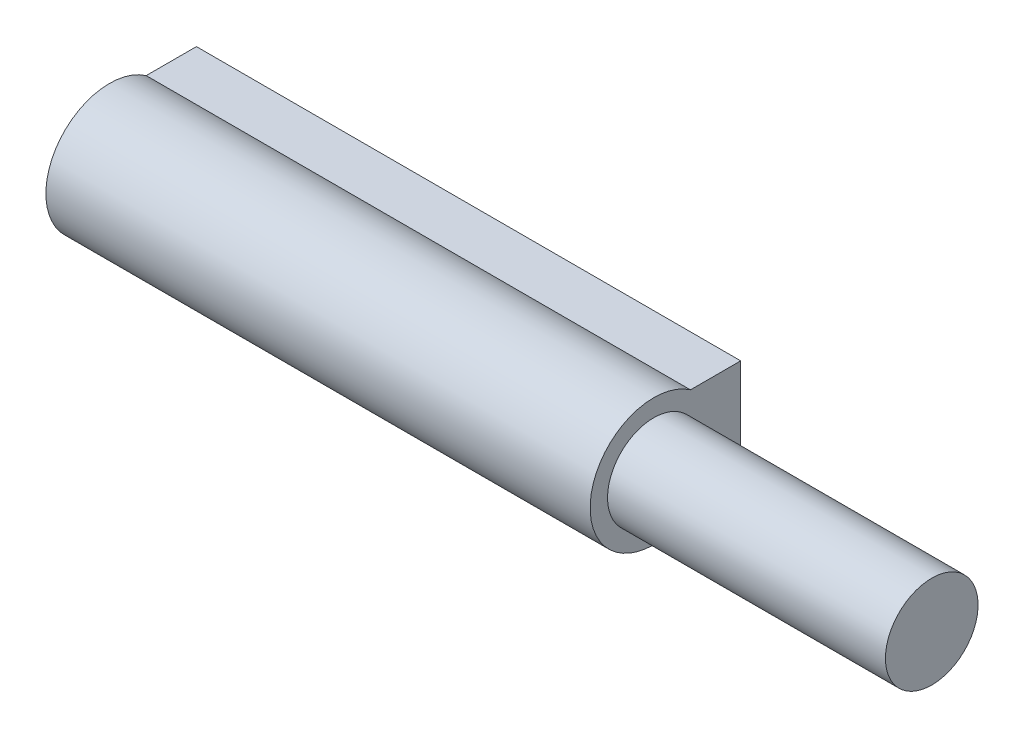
ISO-10303-21;
HEADER;
FILE_DESCRIPTION(('STEP AP214'),'2;1');
FILE_NAME('part.step','',(''),(''),'','','');
FILE_SCHEMA(('AUTOMOTIVE_DESIGN { 1 0 10303 214 1 1 1 1 }'));
ENDSEC;
DATA;
#1=APPLICATION_CONTEXT('core data for automotive mechanical design processes');
#2=APPLICATION_PROTOCOL_DEFINITION('international standard','automotive_design',2000,#1);
#3=PRODUCT_CONTEXT('',#1,'mechanical');
#4=PRODUCT('Part','Part','',(#3));
#5=PRODUCT_RELATED_PRODUCT_CATEGORY('part','',(#4));
#6=PRODUCT_DEFINITION_FORMATION('','',#4);
#7=PRODUCT_DEFINITION_CONTEXT('part definition',#1,'design');
#8=PRODUCT_DEFINITION('design','',#6,#7);
#9=PRODUCT_DEFINITION_SHAPE('','',#8);
#10=(LENGTH_UNIT() NAMED_UNIT(*) SI_UNIT(.MILLI.,.METRE.));
#11=(NAMED_UNIT(*) PLANE_ANGLE_UNIT() SI_UNIT($,.RADIAN.));
#12=(NAMED_UNIT(*) SI_UNIT($,.STERADIAN.) SOLID_ANGLE_UNIT());
#13=UNCERTAINTY_MEASURE_WITH_UNIT(LENGTH_MEASURE(1.E-05),#10,'distance_accuracy_value','');
#14=(GEOMETRIC_REPRESENTATION_CONTEXT(3) GLOBAL_UNCERTAINTY_ASSIGNED_CONTEXT((#13)) GLOBAL_UNIT_ASSIGNED_CONTEXT((#10,
#11,#12)) REPRESENTATION_CONTEXT('',''));
#15=CARTESIAN_POINT('',(0.,0.,0.));
#16=DIRECTION('',(0.,0.,1.));
#17=DIRECTION('',(1.,0.,0.));
#18=AXIS2_PLACEMENT_3D('',#15,#16,#17);
#19=CARTESIAN_POINT('',(39.5,0.,7.5));
#20=DIRECTION('',(-1.,0.,0.));
#21=DIRECTION('',(0.,0.,-1.));
#22=AXIS2_PLACEMENT_3D('',#19,#20,#21);
#23=PLANE('',#22);
#24=CARTESIAN_POINT('',(39.5,0.,7.5));
#25=DIRECTION('',(-1.,0.,0.));
#26=DIRECTION('',(0.,0.,-1.));
#27=AXIS2_PLACEMENT_3D('',#24,#25,#26);
#28=CIRCLE('',#27,5.5);
#29=CARTESIAN_POINT('',(39.5,-4.5,4.33772233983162));
#30=VERTEX_POINT('',#29);
#31=CARTESIAN_POINT('',(39.5,4.5,4.33772233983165));
#32=VERTEX_POINT('',#31);
#33=EDGE_CURVE('E68',#30,#32,#28,.T.);
#34=ORIENTED_EDGE('',*,*,#33,.F.);
#35=DIRECTION('',(0.,0.,-1.));
#36=VECTOR('',#35,1.);
#37=CARTESIAN_POINT('',(39.5,-4.5,4.33772233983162));
#38=LINE('',#37,#36);
#39=CARTESIAN_POINT('',(39.5,-4.5,0.));
#40=VERTEX_POINT('',#39);
#41=EDGE_CURVE('E77',#30,#40,#38,.T.);
#42=ORIENTED_EDGE('',*,*,#41,.T.);
#43=DIRECTION('',(0.,1.,0.));
#44=VECTOR('',#43,1.);
#45=CARTESIAN_POINT('',(39.5,-4.5,0.));
#46=LINE('',#45,#44);
#47=CARTESIAN_POINT('',(39.5,4.5,0.));
#48=VERTEX_POINT('',#47);
#49=EDGE_CURVE('E75',#40,#48,#46,.T.);
#50=ORIENTED_EDGE('',*,*,#49,.T.);
#51=DIRECTION('',(0.,0.,-1.));
#52=VECTOR('',#51,1.);
#53=CARTESIAN_POINT('',(39.5,4.5,4.33772233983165));
#54=LINE('',#53,#52);
#55=EDGE_CURVE('E60',#32,#48,#54,.T.);
#56=ORIENTED_EDGE('',*,*,#55,.F.);
#57=EDGE_LOOP('',(#34,#42,#50,#56));
#58=FACE_BOUND('',#57,.T.);
#59=CARTESIAN_POINT('',(39.5,0.,7.5));
#60=DIRECTION('',(1.,0.,0.));
#61=DIRECTION('',(0.,0.,1.));
#62=AXIS2_PLACEMENT_3D('',#59,#60,#61);
#63=CIRCLE('',#62,4.);
#64=CARTESIAN_POINT('',(39.5,0.,11.5));
#65=VERTEX_POINT('',#64);
#66=EDGE_CURVE('E9',#65,#65,#63,.T.);
#67=ORIENTED_EDGE('',*,*,#66,.F.);
#68=EDGE_LOOP('',(#67));
#69=FACE_BOUND('',#68,.T.);
#70=ADVANCED_FACE('F14',(#58,#69),#23,.F.);
#71=CARTESIAN_POINT('',(-7.5,0.,7.5));
#72=DIRECTION('',(1.,0.,0.));
#73=DIRECTION('',(0.,0.,1.));
#74=AXIS2_PLACEMENT_3D('',#71,#72,#73);
#75=CYLINDRICAL_SURFACE('',#74,5.5);
#76=DIRECTION('',(1.,0.,0.));
#77=VECTOR('',#76,1.);
#78=CARTESIAN_POINT('',(-7.5,4.5,4.33772233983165));
#79=LINE('',#78,#77);
#80=CARTESIAN_POINT('',(-7.5,4.5,4.33772233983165));
#81=VERTEX_POINT('',#80);
#82=EDGE_CURVE('E18',#81,#32,#79,.T.);
#83=ORIENTED_EDGE('',*,*,#82,.F.);
#84=CARTESIAN_POINT('',(-7.5,0.,7.5));
#85=DIRECTION('',(-1.,0.,0.));
#86=DIRECTION('',(0.,0.,-1.));
#87=AXIS2_PLACEMENT_3D('',#84,#85,#86);
#88=CIRCLE('',#87,5.5);
#89=CARTESIAN_POINT('',(-7.5,-4.5,4.33772233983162));
#90=VERTEX_POINT('',#89);
#91=EDGE_CURVE('E82',#90,#81,#88,.T.);
#92=ORIENTED_EDGE('',*,*,#91,.F.);
#93=DIRECTION('',(1.,0.,0.));
#94=VECTOR('',#93,1.);
#95=CARTESIAN_POINT('',(-7.5,-4.5,4.33772233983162));
#96=LINE('',#95,#94);
#97=EDGE_CURVE('E30',#90,#30,#96,.T.);
#98=ORIENTED_EDGE('',*,*,#97,.T.);
#99=ORIENTED_EDGE('',*,*,#33,.T.);
#100=EDGE_LOOP('',(#83,#92,#98,#99));
#101=FACE_BOUND('',#100,.T.);
#102=ADVANCED_FACE('F69',(#101),#75,.T.);
#103=CARTESIAN_POINT('',(-7.5,4.5,4.33772233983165));
#104=DIRECTION('',(0.,-1.,0.));
#105=DIRECTION('',(0.,0.,1.));
#106=AXIS2_PLACEMENT_3D('',#103,#104,#105);
#107=PLANE('',#106);
#108=DIRECTION('',(1.,0.,0.));
#109=VECTOR('',#108,1.);
#110=CARTESIAN_POINT('',(-7.5,4.5,0.));
#111=LINE('',#110,#109);
#112=CARTESIAN_POINT('',(-7.5,4.5,0.));
#113=VERTEX_POINT('',#112);
#114=EDGE_CURVE('E66',#113,#48,#111,.T.);
#115=ORIENTED_EDGE('',*,*,#114,.F.);
#116=DIRECTION('',(0.,0.,-1.));
#117=VECTOR('',#116,1.);
#118=CARTESIAN_POINT('',(-7.5,4.5,4.33772233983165));
#119=LINE('',#118,#117);
#120=EDGE_CURVE('E63',#81,#113,#119,.T.);
#121=ORIENTED_EDGE('',*,*,#120,.F.);
#122=ORIENTED_EDGE('',*,*,#82,.T.);
#123=ORIENTED_EDGE('',*,*,#55,.T.);
#124=EDGE_LOOP('',(#115,#121,#122,#123));
#125=FACE_BOUND('',#124,.T.);
#126=ADVANCED_FACE('F16',(#125),#107,.F.);
#127=CARTESIAN_POINT('',(-7.5,-4.5,0.));
#128=DIRECTION('',(0.,0.,-1.));
#129=DIRECTION('',(0.,-1.,0.));
#130=AXIS2_PLACEMENT_3D('',#127,#128,#129);
#131=PLANE('',#130);
#132=CARTESIAN_POINT('',(0.,0.,0.));
#133=DIRECTION('',(0.,0.,-1.));
#134=DIRECTION('',(0.,-1.,0.));
#135=AXIS2_PLACEMENT_3D('',#132,#133,#134);
#136=CIRCLE('',#135,2.5);
#137=CARTESIAN_POINT('',(0.,-2.5,0.));
#138=VERTEX_POINT('',#137);
#139=EDGE_CURVE('E145',#138,#138,#136,.T.);
#140=ORIENTED_EDGE('',*,*,#139,.F.);
#141=EDGE_LOOP('',(#140));
#142=FACE_BOUND('',#141,.T.);
#143=CARTESIAN_POINT('',(30.,0.,0.));
#144=DIRECTION('',(0.,0.,-1.));
#145=DIRECTION('',(0.,-1.,0.));
#146=AXIS2_PLACEMENT_3D('',#143,#144,#145);
#147=CIRCLE('',#146,2.5);
#148=CARTESIAN_POINT('',(30.,-2.5,0.));
#149=VERTEX_POINT('',#148);
#150=EDGE_CURVE('E150',#149,#149,#147,.T.);
#151=ORIENTED_EDGE('',*,*,#150,.F.);
#152=EDGE_LOOP('',(#151));
#153=FACE_BOUND('',#152,.T.);
#154=DIRECTION('',(1.,0.,0.));
#155=VECTOR('',#154,1.);
#156=CARTESIAN_POINT('',(-7.5,-4.5,0.));
#157=LINE('',#156,#155);
#158=CARTESIAN_POINT('',(-7.5,-4.5,0.));
#159=VERTEX_POINT('',#158);
#160=EDGE_CURVE('E38',#159,#40,#157,.T.);
#161=ORIENTED_EDGE('',*,*,#160,.F.);
#162=DIRECTION('',(0.,1.,0.));
#163=VECTOR('',#162,1.);
#164=CARTESIAN_POINT('',(-7.5,-4.5,0.));
#165=LINE('',#164,#163);
#166=EDGE_CURVE('E85',#159,#113,#165,.T.);
#167=ORIENTED_EDGE('',*,*,#166,.T.);
#168=ORIENTED_EDGE('',*,*,#114,.T.);
#169=ORIENTED_EDGE('',*,*,#49,.F.);
#170=EDGE_LOOP('',(#161,#167,#168,#169));
#171=FACE_BOUND('',#170,.T.);
#172=ADVANCED_FACE('F90',(#142,#153,#171),#131,.T.);
#173=CARTESIAN_POINT('',(-7.5,-4.5,4.33772233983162));
#174=DIRECTION('',(0.,-1.,0.));
#175=DIRECTION('',(-1.,0.,0.));
#176=AXIS2_PLACEMENT_3D('',#173,#174,#175);
#177=PLANE('',#176);
#178=DIRECTION('',(0.,0.,-1.));
#179=VECTOR('',#178,1.);
#180=CARTESIAN_POINT('',(-7.5,-4.5,4.33772233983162));
#181=LINE('',#180,#179);
#182=EDGE_CURVE('E87',#90,#159,#181,.T.);
#183=ORIENTED_EDGE('',*,*,#182,.T.);
#184=ORIENTED_EDGE('',*,*,#160,.T.);
#185=ORIENTED_EDGE('',*,*,#41,.F.);
#186=ORIENTED_EDGE('',*,*,#97,.F.);
#187=EDGE_LOOP('',(#183,#184,#185,#186));
#188=FACE_BOUND('',#187,.T.);
#189=ADVANCED_FACE('F94',(#188),#177,.T.);
#190=CARTESIAN_POINT('',(-7.5,0.,7.5));
#191=DIRECTION('',(-1.,0.,0.));
#192=DIRECTION('',(0.,0.,-1.));
#193=AXIS2_PLACEMENT_3D('',#190,#191,#192);
#194=PLANE('',#193);
#195=ORIENTED_EDGE('',*,*,#91,.T.);
#196=ORIENTED_EDGE('',*,*,#120,.T.);
#197=ORIENTED_EDGE('',*,*,#166,.F.);
#198=ORIENTED_EDGE('',*,*,#182,.F.);
#199=EDGE_LOOP('',(#195,#196,#197,#198));
#200=FACE_BOUND('',#199,.T.);
#201=ADVANCED_FACE('F92',(#200),#194,.T.);
#202=CARTESIAN_POINT('',(63.5,0.,7.5));
#203=DIRECTION('',(-1.,0.,0.));
#204=DIRECTION('',(0.,0.,-1.));
#205=AXIS2_PLACEMENT_3D('',#202,#203,#204);
#206=CYLINDRICAL_SURFACE('',#205,4.);
#207=CARTESIAN_POINT('',(63.5,0.,7.5));
#208=DIRECTION('',(1.,0.,0.));
#209=DIRECTION('',(0.,0.,1.));
#210=AXIS2_PLACEMENT_3D('',#207,#208,#209);
#211=CIRCLE('',#210,4.);
#212=CARTESIAN_POINT('',(63.5,0.,11.5));
#213=VERTEX_POINT('',#212);
#214=EDGE_CURVE('E72',#213,#213,#211,.T.);
#215=ORIENTED_EDGE('',*,*,#214,.F.);
#216=EDGE_LOOP('',(#215));
#217=FACE_BOUND('',#216,.T.);
#218=ORIENTED_EDGE('',*,*,#66,.T.);
#219=EDGE_LOOP('',(#218));
#220=FACE_BOUND('',#219,.T.);
#221=ADVANCED_FACE('F104',(#217,#220),#206,.T.);
#222=CARTESIAN_POINT('',(63.5,0.,7.5));
#223=DIRECTION('',(1.,0.,0.));
#224=DIRECTION('',(0.,0.,1.));
#225=AXIS2_PLACEMENT_3D('',#222,#223,#224);
#226=PLANE('',#225);
#227=ORIENTED_EDGE('',*,*,#214,.T.);
#228=EDGE_LOOP('',(#227));
#229=FACE_BOUND('',#228,.T.);
#230=ADVANCED_FACE('F97',(#229),#226,.T.);
#231=CARTESIAN_POINT('',(30.,0.,11.));
#232=DIRECTION('',(0.,0.,-1.));
#233=DIRECTION('',(0.,-1.,0.));
#234=AXIS2_PLACEMENT_3D('',#231,#232,#233);
#235=CYLINDRICAL_SURFACE('',#234,2.5);
#236=CARTESIAN_POINT('',(30.,0.,6.));
#237=DIRECTION('',(0.,0.,-1.));
#238=DIRECTION('',(-1.,0.,0.));
#239=AXIS2_PLACEMENT_3D('',#236,#237,#238);
#240=CIRCLE('',#239,2.5);
#241=CARTESIAN_POINT('',(27.5,0.,6.));
#242=VERTEX_POINT('',#241);
#243=EDGE_CURVE('E142',#242,#242,#240,.T.);
#244=ORIENTED_EDGE('',*,*,#243,.F.);
#245=EDGE_LOOP('',(#244));
#246=FACE_BOUND('',#245,.T.);
#247=ORIENTED_EDGE('',*,*,#150,.T.);
#248=EDGE_LOOP('',(#247));
#249=FACE_BOUND('',#248,.T.);
#250=ADVANCED_FACE('F109',(#246,#249),#235,.F.);
#251=CARTESIAN_POINT('',(0.,0.,11.));
#252=DIRECTION('',(0.,0.,-1.));
#253=DIRECTION('',(0.,-1.,0.));
#254=AXIS2_PLACEMENT_3D('',#251,#252,#253);
#255=CYLINDRICAL_SURFACE('',#254,2.5);
#256=CARTESIAN_POINT('',(0.,0.,6.));
#257=DIRECTION('',(0.,0.,-1.));
#258=DIRECTION('',(-1.,0.,0.));
#259=AXIS2_PLACEMENT_3D('',#256,#257,#258);
#260=CIRCLE('',#259,2.5);
#261=CARTESIAN_POINT('',(-2.5,0.,6.));
#262=VERTEX_POINT('',#261);
#263=EDGE_CURVE('E141',#262,#262,#260,.T.);
#264=ORIENTED_EDGE('',*,*,#263,.F.);
#265=EDGE_LOOP('',(#264));
#266=FACE_BOUND('',#265,.T.);
#267=ORIENTED_EDGE('',*,*,#139,.T.);
#268=EDGE_LOOP('',(#267));
#269=FACE_BOUND('',#268,.T.);
#270=ADVANCED_FACE('F124',(#266,#269),#255,.F.);
#271=CARTESIAN_POINT('',(30.,0.,6.));
#272=DIRECTION('',(0.,0.,-1.));
#273=DIRECTION('',(-1.,0.,0.));
#274=AXIS2_PLACEMENT_3D('',#271,#272,#273);
#275=PLANE('',#274);
#276=ORIENTED_EDGE('',*,*,#243,.T.);
#277=EDGE_LOOP('',(#276));
#278=FACE_BOUND('',#277,.T.);
#279=ADVANCED_FACE('F128',(#278),#275,.T.);
#280=CARTESIAN_POINT('',(0.,0.,6.));
#281=DIRECTION('',(0.,0.,-1.));
#282=DIRECTION('',(-1.,0.,0.));
#283=AXIS2_PLACEMENT_3D('',#280,#281,#282);
#284=PLANE('',#283);
#285=ORIENTED_EDGE('',*,*,#263,.T.);
#286=EDGE_LOOP('',(#285));
#287=FACE_BOUND('',#286,.T.);
#288=ADVANCED_FACE('F132',(#287),#284,.T.);
#289=CLOSED_SHELL('',(#70,#102,#126,#172,#189,#201,#221,#230,#250,#270,#279,#288));
#290=MANIFOLD_SOLID_BREP('B1',#289);
#291=ADVANCED_BREP_SHAPE_REPRESENTATION('',(#18,#290),#14);
#292=SHAPE_DEFINITION_REPRESENTATION(#9,#291);
ENDSEC;
END-ISO-10303-21;
